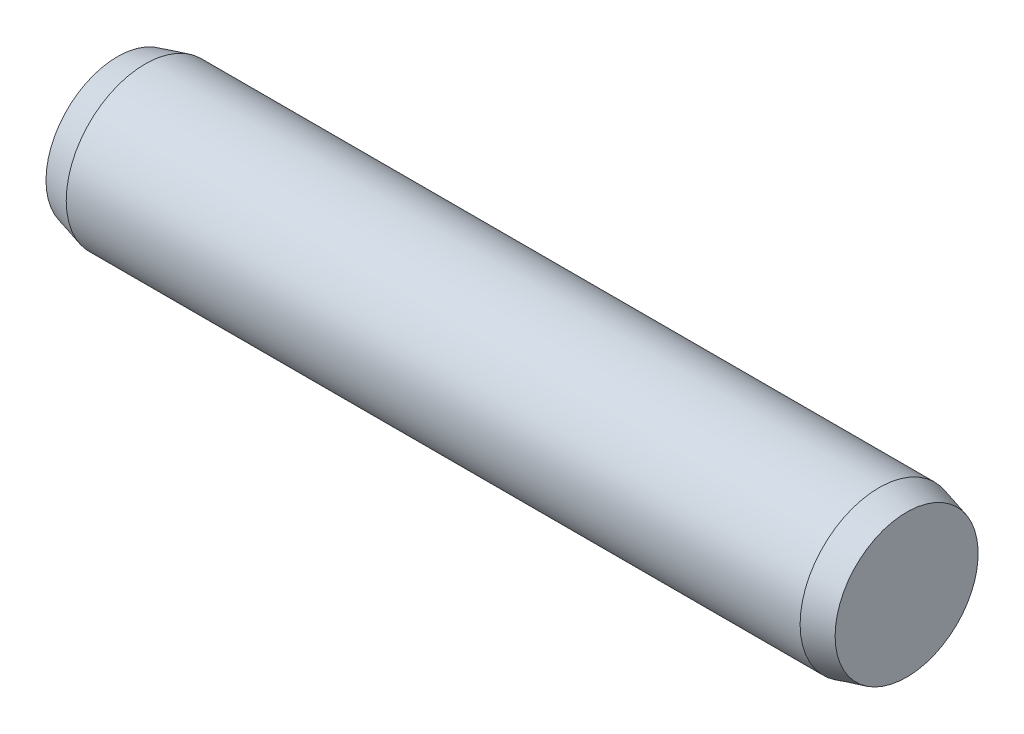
from build123d import *


with BuildPart() as part:
    # Sketch1 → Base-Revolve (revolve)
    with BuildSketch(Plane.XY, mode=Mode.PRIVATE) as base_revolve_sk:
        Polygon((0, 0), (10, 0), (10, 0.906217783), (9.65, 1), (0.35, 1), (0, 0.906217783), align=None)
    revolve(base_revolve_sk.sketch.rotate(Axis((-6.35, 0, 0), (1, 0, 0)), 90), axis=Axis((-6.35, 0, 0), (1, 0, 0)))


solid = part.part
